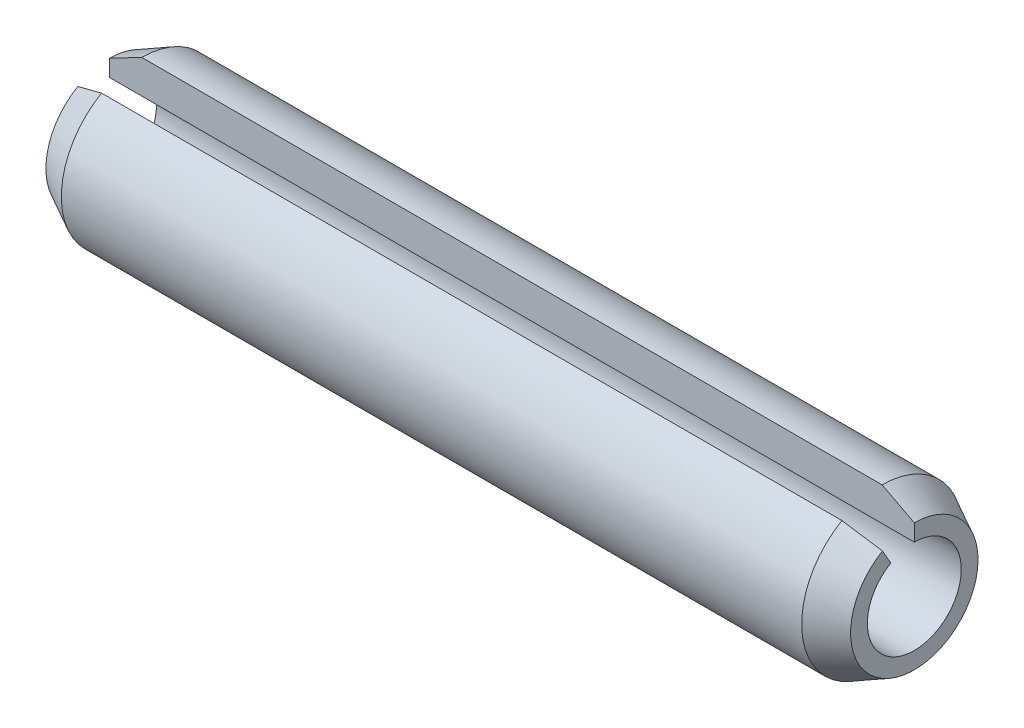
ISO-10303-21;
HEADER;
FILE_DESCRIPTION(('STEP AP214'),'2;1');
FILE_NAME('part.step','',(''),(''),'','','');
FILE_SCHEMA(('AUTOMOTIVE_DESIGN { 1 0 10303 214 1 1 1 1 }'));
ENDSEC;
DATA;
#1=APPLICATION_CONTEXT('core data for automotive mechanical design processes');
#2=APPLICATION_PROTOCOL_DEFINITION('international standard','automotive_design',2000,#1);
#3=PRODUCT_CONTEXT('',#1,'mechanical');
#4=PRODUCT('Part','Part','',(#3));
#5=PRODUCT_RELATED_PRODUCT_CATEGORY('part','',(#4));
#6=PRODUCT_DEFINITION_FORMATION('','',#4);
#7=PRODUCT_DEFINITION_CONTEXT('part definition',#1,'design');
#8=PRODUCT_DEFINITION('design','',#6,#7);
#9=PRODUCT_DEFINITION_SHAPE('','',#8);
#10=(LENGTH_UNIT() NAMED_UNIT(*) SI_UNIT(.MILLI.,.METRE.));
#11=(NAMED_UNIT(*) PLANE_ANGLE_UNIT() SI_UNIT($,.RADIAN.));
#12=(NAMED_UNIT(*) SI_UNIT($,.STERADIAN.) SOLID_ANGLE_UNIT());
#13=UNCERTAINTY_MEASURE_WITH_UNIT(LENGTH_MEASURE(1.E-05),#10,'distance_accuracy_value','');
#14=(GEOMETRIC_REPRESENTATION_CONTEXT(3) GLOBAL_UNCERTAINTY_ASSIGNED_CONTEXT((#13)) GLOBAL_UNIT_ASSIGNED_CONTEXT((#10,
#11,#12)) REPRESENTATION_CONTEXT('',''));
#15=CARTESIAN_POINT('',(0.,0.,0.));
#16=DIRECTION('',(0.,0.,1.));
#17=DIRECTION('',(1.,0.,0.));
#18=AXIS2_PLACEMENT_3D('',#15,#16,#17);
#19=CARTESIAN_POINT('',(2.40000000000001,0.,0.));
#20=DIRECTION('',(0.999999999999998,0.,0.));
#21=DIRECTION('',(0.,1.,0.));
#22=AXIS2_PLACEMENT_3D('',#19,#20,#21);
#23=CONICAL_SURFACE('',#22,6.,0.480175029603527);
#24=CARTESIAN_POINT('',(0.,0.,0.));
#25=DIRECTION('',(0.999999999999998,0.,0.));
#26=DIRECTION('',(0.,1.,0.));
#27=AXIS2_PLACEMENT_3D('',#24,#25,#26);
#28=CIRCLE('',#27,4.75);
#29=CARTESIAN_POINT('',(0.,4.11362066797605,2.37500000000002));
#30=VERTEX_POINT('',#29);
#31=CARTESIAN_POINT('',(0.,4.75000000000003,0.));
#32=VERTEX_POINT('',#31);
#33=EDGE_CURVE('E46',#30,#32,#28,.T.);
#34=ORIENTED_EDGE('',*,*,#33,.T.);
#35=DIRECTION('',(-0.886914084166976,-0.461934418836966,0.));
#36=VECTOR('',#35,1.);
#37=CARTESIAN_POINT('',(2.39999999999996,6.00000000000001,0.));
#38=LINE('',#37,#36);
#39=CARTESIAN_POINT('',(2.39999999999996,6.00000000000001,0.));
#40=VERTEX_POINT('',#39);
#41=EDGE_CURVE('E133',#40,#32,#38,.T.);
#42=ORIENTED_EDGE('',*,*,#41,.F.);
#43=CARTESIAN_POINT('',(2.40000000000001,0.,0.));
#44=DIRECTION('',(0.999999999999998,0.,0.));
#45=DIRECTION('',(0.,1.,0.));
#46=AXIS2_PLACEMENT_3D('',#43,#44,#45);
#47=CIRCLE('',#46,6.);
#48=CARTESIAN_POINT('',(2.39999999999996,5.19615242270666,3.00000000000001));
#49=VERTEX_POINT('',#48);
#50=EDGE_CURVE('E96',#49,#40,#47,.T.);
#51=ORIENTED_EDGE('',*,*,#50,.F.);
#52=DIRECTION('',(-0.886914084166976,-0.400046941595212,-0.230967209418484));
#53=VECTOR('',#52,1.);
#54=CARTESIAN_POINT('',(2.39999999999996,5.19615242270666,3.00000000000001));
#55=LINE('',#54,#53);
#56=EDGE_CURVE('E135',#49,#30,#55,.T.);
#57=ORIENTED_EDGE('',*,*,#56,.T.);
#58=EDGE_LOOP('',(#34,#42,#51,#57));
#59=FACE_BOUND('',#58,.T.);
#60=ADVANCED_FACE('F81',(#59),#23,.T.);
#61=CARTESIAN_POINT('',(0.,4.11362066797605,2.37500000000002));
#62=DIRECTION('',(-0.999999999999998,0.,0.));
#63=DIRECTION('',(0.,-1.,0.));
#64=AXIS2_PLACEMENT_3D('',#61,#62,#63);
#65=PLANE('',#64);
#66=CARTESIAN_POINT('',(0.,0.,0.));
#67=DIRECTION('',(0.999999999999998,0.,0.));
#68=DIRECTION('',(0.,1.,0.));
#69=AXIS2_PLACEMENT_3D('',#66,#67,#68);
#70=CIRCLE('',#69,3.5);
#71=CARTESIAN_POINT('',(0.,3.03108891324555,1.75000000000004));
#72=VERTEX_POINT('',#71);
#73=CARTESIAN_POINT('',(0.,3.49999999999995,0.));
#74=VERTEX_POINT('',#73);
#75=EDGE_CURVE('E89',#72,#74,#70,.T.);
#76=ORIENTED_EDGE('',*,*,#75,.T.);
#77=DIRECTION('',(0.,-1.,0.));
#78=VECTOR('',#77,1.);
#79=CARTESIAN_POINT('',(0.,4.75000000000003,0.));
#80=LINE('',#79,#78);
#81=EDGE_CURVE('E144',#32,#74,#80,.T.);
#82=ORIENTED_EDGE('',*,*,#81,.F.);
#83=ORIENTED_EDGE('',*,*,#33,.F.);
#84=DIRECTION('',(0.,-0.866025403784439,-0.499999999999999));
#85=VECTOR('',#84,1.);
#86=CARTESIAN_POINT('',(0.,4.11362066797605,2.37500000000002));
#87=LINE('',#86,#85);
#88=EDGE_CURVE('E160',#30,#72,#87,.T.);
#89=ORIENTED_EDGE('',*,*,#88,.T.);
#90=EDGE_LOOP('',(#76,#82,#83,#89));
#91=FACE_BOUND('',#90,.T.);
#92=ADVANCED_FACE('F83',(#91),#65,.T.);
#93=CARTESIAN_POINT('',(59.9999999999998,0.,0.));
#94=DIRECTION('',(0.999999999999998,0.,0.));
#95=DIRECTION('',(0.,1.,0.));
#96=AXIS2_PLACEMENT_3D('',#93,#94,#95);
#97=CYLINDRICAL_SURFACE('',#96,3.5);
#98=CARTESIAN_POINT('',(59.9999999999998,0.,0.));
#99=DIRECTION('',(0.999999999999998,0.,0.));
#100=DIRECTION('',(0.,1.,0.));
#101=AXIS2_PLACEMENT_3D('',#98,#99,#100);
#102=CIRCLE('',#101,3.5);
#103=CARTESIAN_POINT('',(59.9999999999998,3.03108891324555,1.75000000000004));
#104=VERTEX_POINT('',#103);
#105=CARTESIAN_POINT('',(59.9999999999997,3.49999999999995,0.));
#106=VERTEX_POINT('',#105);
#107=EDGE_CURVE('E176',#104,#106,#102,.T.);
#108=ORIENTED_EDGE('',*,*,#107,.T.);
#109=DIRECTION('',(0.999999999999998,0.,0.));
#110=VECTOR('',#109,1.);
#111=CARTESIAN_POINT('',(0.,3.49999999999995,0.));
#112=LINE('',#111,#110);
#113=EDGE_CURVE('E149',#74,#106,#112,.T.);
#114=ORIENTED_EDGE('',*,*,#113,.F.);
#115=ORIENTED_EDGE('',*,*,#75,.F.);
#116=DIRECTION('',(0.999999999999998,0.,0.));
#117=VECTOR('',#116,1.);
#118=CARTESIAN_POINT('',(0.,3.03108891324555,1.75000000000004));
#119=LINE('',#118,#117);
#120=EDGE_CURVE('E162',#72,#104,#119,.T.);
#121=ORIENTED_EDGE('',*,*,#120,.T.);
#122=EDGE_LOOP('',(#108,#114,#115,#121));
#123=FACE_BOUND('',#122,.T.);
#124=ADVANCED_FACE('F178',(#123),#97,.F.);
#125=CARTESIAN_POINT('',(59.9999999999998,3.03108891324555,1.75000000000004));
#126=DIRECTION('',(0.999999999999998,0.,0.));
#127=DIRECTION('',(0.,1.,0.));
#128=AXIS2_PLACEMENT_3D('',#125,#126,#127);
#129=PLANE('',#128);
#130=CARTESIAN_POINT('',(59.9999999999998,0.,0.));
#131=DIRECTION('',(0.999999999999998,0.,0.));
#132=DIRECTION('',(0.,1.,0.));
#133=AXIS2_PLACEMENT_3D('',#130,#131,#132);
#134=CIRCLE('',#133,4.75);
#135=CARTESIAN_POINT('',(59.9999999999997,4.11362066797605,2.37500000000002));
#136=VERTEX_POINT('',#135);
#137=CARTESIAN_POINT('',(60.,4.75000000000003,0.));
#138=VERTEX_POINT('',#137);
#139=EDGE_CURVE('E174',#136,#138,#134,.T.);
#140=ORIENTED_EDGE('',*,*,#139,.T.);
#141=DIRECTION('',(0.,1.,0.));
#142=VECTOR('',#141,1.);
#143=CARTESIAN_POINT('',(59.9999999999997,3.49999999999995,0.));
#144=LINE('',#143,#142);
#145=EDGE_CURVE('E151',#106,#138,#144,.T.);
#146=ORIENTED_EDGE('',*,*,#145,.F.);
#147=ORIENTED_EDGE('',*,*,#107,.F.);
#148=DIRECTION('',(0.,0.866025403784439,0.499999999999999));
#149=VECTOR('',#148,1.);
#150=CARTESIAN_POINT('',(59.9999999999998,3.03108891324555,1.75000000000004));
#151=LINE('',#150,#149);
#152=EDGE_CURVE('E165',#104,#136,#151,.T.);
#153=ORIENTED_EDGE('',*,*,#152,.T.);
#154=EDGE_LOOP('',(#140,#146,#147,#153));
#155=FACE_BOUND('',#154,.T.);
#156=ADVANCED_FACE('F184',(#155),#129,.T.);
#157=CARTESIAN_POINT('',(59.9999999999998,0.,0.));
#158=DIRECTION('',(-0.999999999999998,0.,0.));
#159=DIRECTION('',(0.,-1.,0.));
#160=AXIS2_PLACEMENT_3D('',#157,#158,#159);
#161=CONICAL_SURFACE('',#160,4.75,0.480175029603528);
#162=CARTESIAN_POINT('',(57.5999999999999,0.,0.));
#163=DIRECTION('',(0.999999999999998,0.,0.));
#164=DIRECTION('',(0.,1.,0.));
#165=AXIS2_PLACEMENT_3D('',#162,#163,#164);
#166=CIRCLE('',#165,6.);
#167=CARTESIAN_POINT('',(57.6,5.19615242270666,3.00000000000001));
#168=VERTEX_POINT('',#167);
#169=CARTESIAN_POINT('',(57.6,6.00000000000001,0.));
#170=VERTEX_POINT('',#169);
#171=EDGE_CURVE('E104',#168,#170,#166,.T.);
#172=ORIENTED_EDGE('',*,*,#171,.T.);
#173=DIRECTION('',(-0.886914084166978,0.461934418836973,0.));
#174=VECTOR('',#173,1.);
#175=CARTESIAN_POINT('',(60.,4.75000000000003,0.));
#176=LINE('',#175,#174);
#177=EDGE_CURVE('E156',#138,#170,#176,.T.);
#178=ORIENTED_EDGE('',*,*,#177,.F.);
#179=ORIENTED_EDGE('',*,*,#139,.F.);
#180=DIRECTION('',(-0.886914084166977,0.40004694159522,0.230967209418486));
#181=VECTOR('',#180,1.);
#182=CARTESIAN_POINT('',(59.9999999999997,4.11362066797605,2.37500000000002));
#183=LINE('',#182,#181);
#184=EDGE_CURVE('E168',#136,#168,#183,.T.);
#185=ORIENTED_EDGE('',*,*,#184,.T.);
#186=EDGE_LOOP('',(#172,#178,#179,#185));
#187=FACE_BOUND('',#186,.T.);
#188=ADVANCED_FACE('F187',(#187),#161,.T.);
#189=CARTESIAN_POINT('',(59.9999999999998,0.,0.));
#190=DIRECTION('',(0.999999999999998,0.,0.));
#191=DIRECTION('',(0.,1.,0.));
#192=AXIS2_PLACEMENT_3D('',#189,#190,#191);
#193=CYLINDRICAL_SURFACE('',#192,6.);
#194=DIRECTION('',(-0.999999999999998,0.,0.));
#195=VECTOR('',#194,1.);
#196=CARTESIAN_POINT('',(57.6,5.19615242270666,3.00000000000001));
#197=LINE('',#196,#195);
#198=EDGE_CURVE('E170',#168,#49,#197,.T.);
#199=ORIENTED_EDGE('',*,*,#198,.T.);
#200=ORIENTED_EDGE('',*,*,#50,.T.);
#201=DIRECTION('',(-0.999999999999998,0.,0.));
#202=VECTOR('',#201,1.);
#203=CARTESIAN_POINT('',(57.6,6.00000000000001,0.));
#204=LINE('',#203,#202);
#205=EDGE_CURVE('E147',#170,#40,#204,.T.);
#206=ORIENTED_EDGE('',*,*,#205,.F.);
#207=ORIENTED_EDGE('',*,*,#171,.F.);
#208=EDGE_LOOP('',(#199,#200,#206,#207));
#209=FACE_BOUND('',#208,.T.);
#210=ADVANCED_FACE('F189',(#209),#193,.T.);
#211=CARTESIAN_POINT('',(0.,4.11362066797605,2.37500000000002));
#212=DIRECTION('',(0.,-0.5,0.866025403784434));
#213=DIRECTION('',(0.999999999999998,0.,0.));
#214=AXIS2_PLACEMENT_3D('',#211,#212,#213);
#215=PLANE('',#214);
#216=ORIENTED_EDGE('',*,*,#56,.F.);
#217=ORIENTED_EDGE('',*,*,#198,.F.);
#218=ORIENTED_EDGE('',*,*,#184,.F.);
#219=ORIENTED_EDGE('',*,*,#152,.F.);
#220=ORIENTED_EDGE('',*,*,#120,.F.);
#221=ORIENTED_EDGE('',*,*,#88,.F.);
#222=EDGE_LOOP('',(#216,#217,#218,#219,#220,#221));
#223=FACE_BOUND('',#222,.T.);
#224=ADVANCED_FACE('F191',(#223),#215,.F.);
#225=CARTESIAN_POINT('',(0.,4.75000000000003,0.));
#226=DIRECTION('',(0.,0.,0.999999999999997));
#227=DIRECTION('',(0.999999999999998,0.,0.));
#228=AXIS2_PLACEMENT_3D('',#225,#226,#227);
#229=PLANE('',#228);
#230=ORIENTED_EDGE('',*,*,#41,.T.);
#231=ORIENTED_EDGE('',*,*,#81,.T.);
#232=ORIENTED_EDGE('',*,*,#113,.T.);
#233=ORIENTED_EDGE('',*,*,#145,.T.);
#234=ORIENTED_EDGE('',*,*,#177,.T.);
#235=ORIENTED_EDGE('',*,*,#205,.T.);
#236=EDGE_LOOP('',(#230,#231,#232,#233,#234,#235));
#237=FACE_BOUND('',#236,.T.);
#238=ADVANCED_FACE('F142',(#237),#229,.T.);
#239=CLOSED_SHELL('',(#60,#92,#124,#156,#188,#210,#224,#238));
#240=MANIFOLD_SOLID_BREP('B6',#239);
#241=ADVANCED_BREP_SHAPE_REPRESENTATION('',(#18,#240),#14);
#242=SHAPE_DEFINITION_REPRESENTATION(#9,#241);
ENDSEC;
END-ISO-10303-21;
